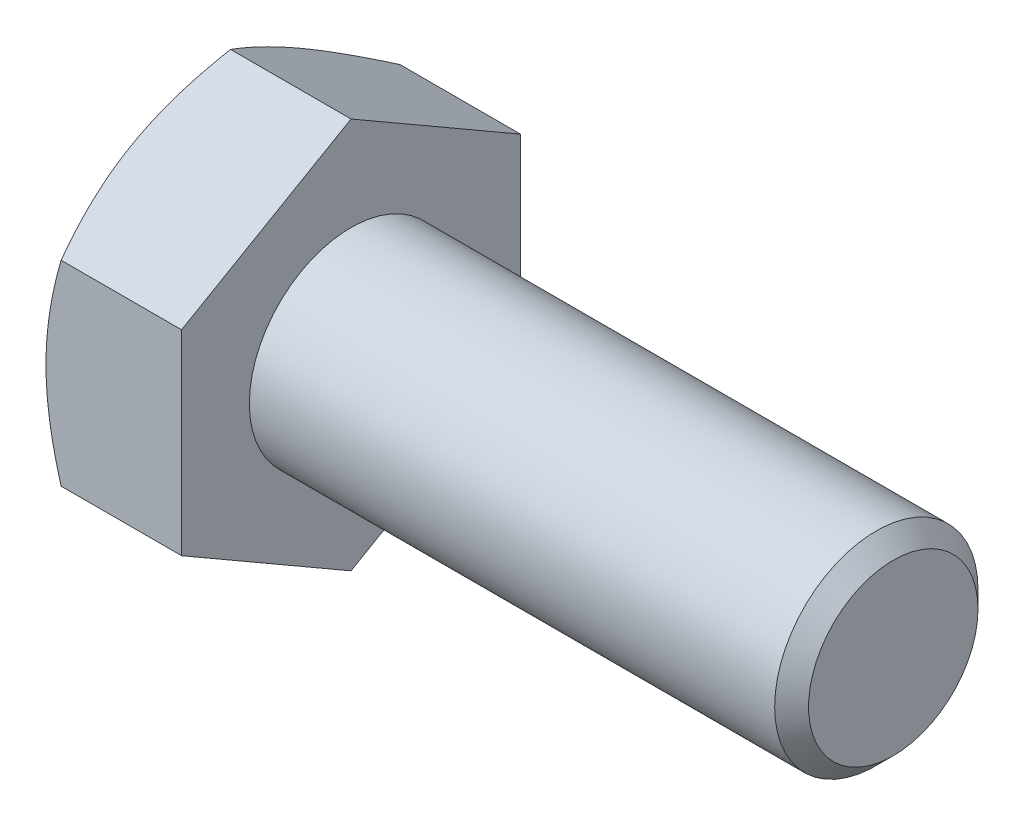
ISO-10303-21;
HEADER;
FILE_DESCRIPTION(('STEP AP214'),'2;1');
FILE_NAME('part.step','',(''),(''),'','','');
FILE_SCHEMA(('AUTOMOTIVE_DESIGN { 1 0 10303 214 1 1 1 1 }'));
ENDSEC;
DATA;
#1=APPLICATION_CONTEXT('core data for automotive mechanical design processes');
#2=APPLICATION_PROTOCOL_DEFINITION('international standard','automotive_design',2000,#1);
#3=PRODUCT_CONTEXT('',#1,'mechanical');
#4=PRODUCT('Part','Part','',(#3));
#5=PRODUCT_RELATED_PRODUCT_CATEGORY('part','',(#4));
#6=PRODUCT_DEFINITION_FORMATION('','',#4);
#7=PRODUCT_DEFINITION_CONTEXT('part definition',#1,'design');
#8=PRODUCT_DEFINITION('design','',#6,#7);
#9=PRODUCT_DEFINITION_SHAPE('','',#8);
#10=(LENGTH_UNIT() NAMED_UNIT(*) SI_UNIT(.MILLI.,.METRE.));
#11=(NAMED_UNIT(*) PLANE_ANGLE_UNIT() SI_UNIT($,.RADIAN.));
#12=(NAMED_UNIT(*) SI_UNIT($,.STERADIAN.) SOLID_ANGLE_UNIT());
#13=UNCERTAINTY_MEASURE_WITH_UNIT(LENGTH_MEASURE(1.E-05),#10,'distance_accuracy_value','');
#14=(GEOMETRIC_REPRESENTATION_CONTEXT(3) GLOBAL_UNCERTAINTY_ASSIGNED_CONTEXT((#13)) GLOBAL_UNIT_ASSIGNED_CONTEXT((#10,
#11,#12)) REPRESENTATION_CONTEXT('',''));
#15=CARTESIAN_POINT('',(0.,0.,0.));
#16=DIRECTION('',(0.,0.,1.));
#17=DIRECTION('',(1.,0.,0.));
#18=AXIS2_PLACEMENT_3D('',#15,#16,#17);
#19=CARTESIAN_POINT('',(16.,0.,0.));
#20=DIRECTION('',(-1.,0.,0.));
#21=DIRECTION('',(0.,0.,1.));
#22=AXIS2_PLACEMENT_3D('',#19,#20,#21);
#23=CYLINDRICAL_SURFACE('',#22,3.);
#24=CARTESIAN_POINT('',(15.5,0.,0.));
#25=DIRECTION('',(1.,0.,0.));
#26=DIRECTION('',(0.,0.,-1.));
#27=AXIS2_PLACEMENT_3D('',#24,#25,#26);
#28=CIRCLE('',#27,3.);
#29=CARTESIAN_POINT('',(15.5,0.,-3.));
#30=VERTEX_POINT('',#29);
#31=EDGE_CURVE('E11',#30,#30,#28,.F.);
#32=ORIENTED_EDGE('',*,*,#31,.T.);
#33=EDGE_LOOP('',(#32));
#34=FACE_BOUND('',#33,.T.);
#35=CARTESIAN_POINT('',(0.,0.,0.));
#36=DIRECTION('',(-1.,0.,0.));
#37=DIRECTION('',(0.,0.,1.));
#38=AXIS2_PLACEMENT_3D('',#35,#36,#37);
#39=CIRCLE('',#38,3.);
#40=CARTESIAN_POINT('',(0.,0.,3.));
#41=VERTEX_POINT('',#40);
#42=EDGE_CURVE('E204',#41,#41,#39,.T.);
#43=ORIENTED_EDGE('',*,*,#42,.F.);
#44=EDGE_LOOP('',(#43));
#45=FACE_BOUND('',#44,.T.);
#46=ADVANCED_FACE('F30',(#34,#45),#23,.T.);
#47=CARTESIAN_POINT('',(16.,0.,0.));
#48=DIRECTION('',(1.,0.,0.));
#49=DIRECTION('',(0.,0.,-1.));
#50=AXIS2_PLACEMENT_3D('',#47,#48,#49);
#51=PLANE('',#50);
#52=CARTESIAN_POINT('',(16.,0.,0.));
#53=DIRECTION('',(1.,0.,0.));
#54=DIRECTION('',(0.,0.,-1.));
#55=AXIS2_PLACEMENT_3D('',#52,#53,#54);
#56=CIRCLE('',#55,2.49999999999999);
#57=CARTESIAN_POINT('',(16.,0.,-2.49999999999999));
#58=VERTEX_POINT('',#57);
#59=EDGE_CURVE('E37',#58,#58,#56,.T.);
#60=ORIENTED_EDGE('',*,*,#59,.T.);
#61=EDGE_LOOP('',(#60));
#62=FACE_BOUND('',#61,.T.);
#63=ADVANCED_FACE('F190',(#62),#51,.T.);
#64=CARTESIAN_POINT('',(0.,-2.88675134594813,5.));
#65=DIRECTION('',(-1.,0.,0.));
#66=DIRECTION('',(0.,0.,1.));
#67=AXIS2_PLACEMENT_3D('',#64,#65,#66);
#68=PLANE('',#67);
#69=DIRECTION('',(0.,0.5,0.866025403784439));
#70=VECTOR('',#69,1.);
#71=CARTESIAN_POINT('',(0.,-5.77350269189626,0.));
#72=LINE('',#71,#70);
#73=CARTESIAN_POINT('',(0.,-5.77350269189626,0.));
#74=VERTEX_POINT('',#73);
#75=CARTESIAN_POINT('',(0.,-2.88675134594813,5.));
#76=VERTEX_POINT('',#75);
#77=EDGE_CURVE('E231',#74,#76,#72,.T.);
#78=ORIENTED_EDGE('',*,*,#77,.F.);
#79=DIRECTION('',(0.,0.5,-0.866025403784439));
#80=VECTOR('',#79,1.);
#81=CARTESIAN_POINT('',(0.,-5.77350269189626,0.));
#82=LINE('',#81,#80);
#83=CARTESIAN_POINT('',(0.,-2.88675134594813,-5.));
#84=VERTEX_POINT('',#83);
#85=EDGE_CURVE('E218',#74,#84,#82,.T.);
#86=ORIENTED_EDGE('',*,*,#85,.T.);
#87=DIRECTION('',(0.,1.,0.));
#88=VECTOR('',#87,1.);
#89=CARTESIAN_POINT('',(0.,-2.88675134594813,-5.));
#90=LINE('',#89,#88);
#91=CARTESIAN_POINT('',(0.,2.88675134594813,-5.));
#92=VERTEX_POINT('',#91);
#93=EDGE_CURVE('E221',#84,#92,#90,.T.);
#94=ORIENTED_EDGE('',*,*,#93,.T.);
#95=DIRECTION('',(0.,0.5,0.866025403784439));
#96=VECTOR('',#95,1.);
#97=CARTESIAN_POINT('',(0.,2.88675134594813,-5.));
#98=LINE('',#97,#96);
#99=CARTESIAN_POINT('',(0.,5.77350269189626,0.));
#100=VERTEX_POINT('',#99);
#101=EDGE_CURVE('E224',#92,#100,#98,.T.);
#102=ORIENTED_EDGE('',*,*,#101,.T.);
#103=DIRECTION('',(0.,0.5,-0.866025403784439));
#104=VECTOR('',#103,1.);
#105=CARTESIAN_POINT('',(0.,2.88675134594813,5.));
#106=LINE('',#105,#104);
#107=CARTESIAN_POINT('',(0.,2.88675134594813,5.));
#108=VERTEX_POINT('',#107);
#109=EDGE_CURVE('E227',#108,#100,#106,.T.);
#110=ORIENTED_EDGE('',*,*,#109,.F.);
#111=DIRECTION('',(0.,1.,0.));
#112=VECTOR('',#111,1.);
#113=CARTESIAN_POINT('',(0.,-2.88675134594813,5.));
#114=LINE('',#113,#112);
#115=EDGE_CURVE('E229',#76,#108,#114,.T.);
#116=ORIENTED_EDGE('',*,*,#115,.F.);
#117=EDGE_LOOP('',(#78,#86,#94,#102,#110,#116));
#118=FACE_BOUND('',#117,.T.);
#119=ORIENTED_EDGE('',*,*,#42,.T.);
#120=EDGE_LOOP('',(#119));
#121=FACE_BOUND('',#120,.T.);
#122=ADVANCED_FACE('F161',(#118,#121),#68,.F.);
#123=CARTESIAN_POINT('',(-4.,-5.77350269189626,0.));
#124=DIRECTION('',(0.,0.866025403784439,-0.5));
#125=DIRECTION('',(0.,0.5,0.866025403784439));
#126=AXIS2_PLACEMENT_3D('',#123,#124,#125);
#127=PLANE('',#126);
#128=CARTESIAN_POINT('',(-3.55335134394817,-5.7736181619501,-0.000200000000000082));
#129=CARTESIAN_POINT('',(-3.62661343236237,-5.64675433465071,0.219534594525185));
#130=CARTESIAN_POINT('',(-3.69324867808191,-5.5188054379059,0.44114858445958));
#131=CARTESIAN_POINT('',(-3.80956100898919,-5.26069210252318,0.888213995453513));
#132=CARTESIAN_POINT('',(-3.85919695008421,-5.13052307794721,1.11367335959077));
#133=CARTESIAN_POINT('',(-3.9364489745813,-4.87177839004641,1.56183230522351));
#134=CARTESIAN_POINT('',(-3.96457962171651,-4.74324302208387,1.78446209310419));
#135=CARTESIAN_POINT('',(-3.98980507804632,-4.54998783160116,2.11918990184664));
#136=CARTESIAN_POINT('',(-3.99538654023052,-4.48552534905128,2.23084219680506));
#137=CARTESIAN_POINT('',(-4.00079778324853,-4.35654081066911,2.4542499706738));
#138=CARTESIAN_POINT('',(-4.0006277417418,-4.2920187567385,2.56600544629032));
#139=CARTESIAN_POINT('',(-3.99224636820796,-4.11524635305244,2.87218423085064));
#140=CARTESIAN_POINT('',(-3.97817022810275,-4.00305457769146,3.06650608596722));
#141=CARTESIAN_POINT('',(-3.93353474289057,-3.77941563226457,3.45386010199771));
#142=CARTESIAN_POINT('',(-3.90296013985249,-3.66796924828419,3.64689090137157));
#143=CARTESIAN_POINT('',(-3.82653150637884,-3.44387972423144,4.03502534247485));
#144=CARTESIAN_POINT('',(-3.78035362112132,-3.3312648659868,4.23007999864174));
#145=CARTESIAN_POINT('',(-3.67554820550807,-3.10771464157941,4.61728034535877));
#146=CARTESIAN_POINT('',(-3.61694529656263,-2.99677641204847,4.80943099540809));
#147=CARTESIAN_POINT('',(-3.55335134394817,-2.88663587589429,5.0002));
#148=B_SPLINE_CURVE_WITH_KNOTS('',3,(#128,#129,#130,#131,#132,#133,#134,#135,#136,#137,#138,
#139,#140,#141,#142,#143,#144,#145,#146,#147),.UNSPECIFIED.,.F.,.F.,(4,2,2,2,2,2,2,2,2,4),(0.,
0.79255584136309,1.58701660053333,2.36181537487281,2.74884076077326,3.13585419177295,
3.80962362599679,4.48401723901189,5.17336882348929,5.86136694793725),.UNSPECIFIED.);
#149=CARTESIAN_POINT('',(-3.5534180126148,-5.77350269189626,0.));
#150=VERTEX_POINT('',#149);
#151=CARTESIAN_POINT('',(-4.,-4.3301270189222,2.5));
#152=VERTEX_POINT('',#151);
#153=EDGE_CURVE('E178',#150,#152,#148,.T.);
#154=ORIENTED_EDGE('',*,*,#153,.F.);
#155=DIRECTION('',(1.,0.,0.));
#156=VECTOR('',#155,1.);
#157=CARTESIAN_POINT('',(-4.,-5.77350269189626,0.));
#158=LINE('',#157,#156);
#159=EDGE_CURVE('E216',#150,#74,#158,.T.);
#160=ORIENTED_EDGE('',*,*,#159,.T.);
#161=ORIENTED_EDGE('',*,*,#77,.T.);
#162=DIRECTION('',(1.,0.,0.));
#163=VECTOR('',#162,1.);
#164=CARTESIAN_POINT('',(-4.,-2.88675134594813,5.));
#165=LINE('',#164,#163);
#166=CARTESIAN_POINT('',(-3.5534180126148,-2.88675134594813,5.));
#167=VERTEX_POINT('',#166);
#168=EDGE_CURVE('E207',#167,#76,#165,.T.);
#169=ORIENTED_EDGE('',*,*,#168,.F.);
#170=EDGE_CURVE('E132',#152,#167,#148,.T.);
#171=ORIENTED_EDGE('',*,*,#170,.F.);
#172=EDGE_LOOP('',(#154,#160,#161,#169,#171));
#173=FACE_BOUND('',#172,.T.);
#174=ADVANCED_FACE('F184',(#173),#127,.F.);
#175=CARTESIAN_POINT('',(-4.,-2.88675134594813,5.));
#176=DIRECTION('',(0.,0.,-1.));
#177=DIRECTION('',(-1.,0.,0.));
#178=AXIS2_PLACEMENT_3D('',#175,#176,#177);
#179=PLANE('',#178);
#180=CARTESIAN_POINT('',(-1.50175754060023,-7.8736570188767,5.));
#181=CARTESIAN_POINT('',(-1.6086809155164,-7.65421637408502,5.));
#182=CARTESIAN_POINT('',(-1.71461296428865,-7.43428458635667,5.));
#183=CARTESIAN_POINT('',(-1.92393906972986,-6.99317792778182,5.));
#184=CARTESIAN_POINT('',(-2.02733274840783,-6.77200287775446,5.));
#185=CARTESIAN_POINT('',(-2.23152152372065,-6.32706593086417,5.));
#186=CARTESIAN_POINT('',(-2.33230041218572,-6.10329657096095,5.));
#187=CARTESIAN_POINT('',(-2.52988978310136,-5.65401907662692,5.));
#188=CARTESIAN_POINT('',(-2.62670044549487,-5.42851102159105,5.));
#189=CARTESIAN_POINT('',(-2.81850105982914,-4.96773019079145,5.));
#190=CARTESIAN_POINT('',(-2.91331851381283,-4.73238523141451,5.));
#191=CARTESIAN_POINT('',(-3.09606229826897,-4.25898650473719,5.));
#192=CARTESIAN_POINT('',(-3.18398787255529,-4.02093244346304,5.));
#193=CARTESIAN_POINT('',(-3.35072723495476,-3.54214478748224,5.));
#194=CARTESIAN_POINT('',(-3.42955846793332,-3.30141732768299,5.));
#195=CARTESIAN_POINT('',(-3.57565910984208,-2.81651125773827,5.));
#196=CARTESIAN_POINT('',(-3.64293203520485,-2.5723337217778,5.));
#197=CARTESIAN_POINT('',(-3.7624103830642,-2.08173956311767,5.));
#198=CARTESIAN_POINT('',(-3.81470009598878,-1.83534384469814,5.));
#199=CARTESIAN_POINT('',(-3.90133365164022,-1.33936717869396,5.));
#200=CARTESIAN_POINT('',(-3.93567944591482,-1.08978658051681,5.));
#201=CARTESIAN_POINT('',(-3.98324171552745,-0.59199465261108,5.));
#202=CARTESIAN_POINT('',(-3.99673913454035,-0.343810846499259,5.));
#203=CARTESIAN_POINT('',(-4.00220795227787,0.152820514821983,5.));
#204=CARTESIAN_POINT('',(-3.99417903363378,0.401268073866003,5.));
#205=CARTESIAN_POINT('',(-3.96311999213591,0.819539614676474,5.));
#206=CARTESIAN_POINT('',(-3.94552930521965,0.989794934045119,5.));
#207=CARTESIAN_POINT('',(-3.90127081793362,1.32912938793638,5.));
#208=CARTESIAN_POINT('',(-3.87460188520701,1.4982083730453,5.));
#209=CARTESIAN_POINT('',(-3.78237229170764,2.00341173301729,5.));
#210=CARTESIAN_POINT('',(-3.7046029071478,2.337335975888,5.));
#211=CARTESIAN_POINT('',(-3.56883106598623,2.83691487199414,5.));
#212=CARTESIAN_POINT('',(-3.51971360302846,3.00513229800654,5.));
#213=CARTESIAN_POINT('',(-3.41615110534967,3.33993504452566,5.));
#214=CARTESIAN_POINT('',(-3.36170602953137,3.5065203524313,5.));
#215=CARTESIAN_POINT('',(-3.24838071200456,3.83810926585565,5.));
#216=CARTESIAN_POINT('',(-3.18950171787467,4.00311330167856,5.));
#217=CARTESIAN_POINT('',(-3.0680238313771,4.33173746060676,5.));
#218=CARTESIAN_POINT('',(-3.00542502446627,4.49535761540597,5.));
#219=CARTESIAN_POINT('',(-2.83201950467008,4.93598294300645,5.));
#220=CARTESIAN_POINT('',(-2.71826266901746,5.21182602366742,5.));
#221=CARTESIAN_POINT('',(-2.48405585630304,5.76066658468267,5.));
#222=CARTESIAN_POINT('',(-2.36360513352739,6.03366374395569,5.));
#223=CARTESIAN_POINT('',(-2.11759609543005,6.57746623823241,5.));
#224=CARTESIAN_POINT('',(-1.99203582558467,6.84827068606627,5.));
#225=CARTESIAN_POINT('',(-1.73703058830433,7.38802449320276,5.));
#226=CARTESIAN_POINT('',(-1.60758577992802,7.65697392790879,5.));
#227=CARTESIAN_POINT('',(-1.34544789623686,8.19381940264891,5.));
#228=CARTESIAN_POINT('',(-1.21274991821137,8.46171304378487,5.));
#229=CARTESIAN_POINT('',(-0.944933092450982,8.99628800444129,5.));
#230=CARTESIAN_POINT('',(-0.809814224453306,9.26296931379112,5.));
#231=CARTESIAN_POINT('',(-0.401627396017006,10.0614145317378,5.));
#232=CARTESIAN_POINT('',(-0.125669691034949,10.5917004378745,5.));
#233=CARTESIAN_POINT('',(0.401869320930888,11.5934978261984,5.));
#234=CARTESIAN_POINT('',(0.652934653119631,12.0652823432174,5.));
#235=CARTESIAN_POINT('',(1.15809174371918,13.0072652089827,5.));
#236=CARTESIAN_POINT('',(1.41218368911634,13.4774634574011,5.));
#237=CARTESIAN_POINT('',(1.92174727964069,14.4150598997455,5.));
#238=CARTESIAN_POINT('',(2.17721139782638,14.8824621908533,5.));
#239=CARTESIAN_POINT('',(2.68985606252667,15.8162766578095,5.));
#240=CARTESIAN_POINT('',(2.94703647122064,16.2826889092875,5.));
#241=CARTESIAN_POINT('',(3.20484156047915,16.7487534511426,5.));
#242=B_SPLINE_CURVE_WITH_KNOTS('',3,(#180,#181,#182,#183,#184,#185,#186,#187,#188,#189,#190,
#191,#192,#193,#194,#195,#196,#197,#198,#199,#200,#201,#202,#203,#204,#205,#206,#207,#208,#209,
#210,#211,#212,#213,#214,#215,#216,#217,#218,#219,#220,#221,#222,#223,#224,#225,#226,#227,#228,
#229,#230,#231,#232,#233,#234,#235,#236,#237,#238,#239,#240,#241),.UNSPECIFIED.,.F.,.F.,(4,2,2,
2,2,2,2,2,2,2,2,2,2,2,2,2,2,2,2,2,2,2,2,2,2,2,2,2,2,2,4),(0.,0.732320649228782,1.46474969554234,
2.20096737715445,2.93715163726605,3.69825037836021,4.45943251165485,5.21912936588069,
5.97859468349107,6.73369963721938,7.48872245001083,8.23347928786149,8.97824710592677,
9.49148539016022,10.0047877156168,11.0318914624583,11.5575684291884,12.0832494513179,
12.6087831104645,13.1343047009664,14.0293094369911,14.9244140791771,15.819864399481,
16.7152781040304,17.612136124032,18.5090016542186,20.3023290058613,21.9056050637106,
23.5089806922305,25.106957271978,26.7048070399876),.UNSPECIFIED.);
#243=CARTESIAN_POINT('',(-4.,0.,5.));
#244=VERTEX_POINT('',#243);
#245=EDGE_CURVE('E233',#167,#244,#242,.T.);
#246=ORIENTED_EDGE('',*,*,#245,.F.);
#247=ORIENTED_EDGE('',*,*,#168,.T.);
#248=ORIENTED_EDGE('',*,*,#115,.T.);
#249=DIRECTION('',(1.,0.,0.));
#250=VECTOR('',#249,1.);
#251=CARTESIAN_POINT('',(-4.,2.88675134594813,5.));
#252=LINE('',#251,#250);
#253=CARTESIAN_POINT('',(-3.5534180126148,2.88675134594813,5.));
#254=VERTEX_POINT('',#253);
#255=EDGE_CURVE('E209',#254,#108,#252,.T.);
#256=ORIENTED_EDGE('',*,*,#255,.F.);
#257=EDGE_CURVE('E103',#244,#254,#242,.T.);
#258=ORIENTED_EDGE('',*,*,#257,.F.);
#259=EDGE_LOOP('',(#246,#247,#248,#256,#258));
#260=FACE_BOUND('',#259,.T.);
#261=ADVANCED_FACE('F187',(#260),#179,.F.);
#262=CARTESIAN_POINT('',(-4.,2.88675134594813,5.));
#263=DIRECTION('',(0.,-0.866025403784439,-0.5));
#264=DIRECTION('',(0.,0.5,-0.866025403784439));
#265=AXIS2_PLACEMENT_3D('',#262,#263,#264);
#266=PLANE('',#265);
#267=CARTESIAN_POINT('',(-3.55335134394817,2.88663587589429,5.0002));
#268=CARTESIAN_POINT('',(-3.62661343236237,3.01349970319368,4.78046540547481));
#269=CARTESIAN_POINT('',(-3.69324867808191,3.14144859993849,4.55885141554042));
#270=CARTESIAN_POINT('',(-3.80956100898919,3.39956193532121,4.11178600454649));
#271=CARTESIAN_POINT('',(-3.85919695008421,3.52973095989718,3.88632664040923));
#272=CARTESIAN_POINT('',(-3.9364489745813,3.78847564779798,3.43816769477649));
#273=CARTESIAN_POINT('',(-3.96457962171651,3.91701101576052,3.21553790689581));
#274=CARTESIAN_POINT('',(-3.98980507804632,4.11026620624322,2.88081009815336));
#275=CARTESIAN_POINT('',(-3.99538654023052,4.17472868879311,2.76915780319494));
#276=CARTESIAN_POINT('',(-4.00079778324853,4.30371322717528,2.5457500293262));
#277=CARTESIAN_POINT('',(-4.0006277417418,4.36823528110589,2.43399455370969));
#278=CARTESIAN_POINT('',(-3.99224636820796,4.54500768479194,2.12781576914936));
#279=CARTESIAN_POINT('',(-3.97817022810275,4.65719946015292,1.93349391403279));
#280=CARTESIAN_POINT('',(-3.93353474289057,4.88083840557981,1.54613989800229));
#281=CARTESIAN_POINT('',(-3.90296013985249,4.9922847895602,1.35310909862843));
#282=CARTESIAN_POINT('',(-3.82653150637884,5.21637431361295,0.964974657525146));
#283=CARTESIAN_POINT('',(-3.78035362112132,5.32898917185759,0.769920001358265));
#284=CARTESIAN_POINT('',(-3.67554820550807,5.55253939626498,0.382719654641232));
#285=CARTESIAN_POINT('',(-3.61694529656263,5.66347762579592,0.190569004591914));
#286=CARTESIAN_POINT('',(-3.55335134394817,5.7736181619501,-0.000199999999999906));
#287=B_SPLINE_CURVE_WITH_KNOTS('',3,(#267,#268,#269,#270,#271,#272,#273,#274,#275,#276,#277,
#278,#279,#280,#281,#282,#283,#284,#285,#286),.UNSPECIFIED.,.F.,.F.,(4,2,2,2,2,2,2,2,2,4),(0.,
0.792555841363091,1.58701660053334,2.36181537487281,2.74884076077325,3.13585419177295,
3.80962362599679,4.48401723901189,5.17336882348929,5.86136694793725),.UNSPECIFIED.);
#288=CARTESIAN_POINT('',(-4.,4.33012701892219,2.5));
#289=VERTEX_POINT('',#288);
#290=EDGE_CURVE('E99',#254,#289,#287,.T.);
#291=ORIENTED_EDGE('',*,*,#290,.F.);
#292=ORIENTED_EDGE('',*,*,#255,.T.);
#293=ORIENTED_EDGE('',*,*,#109,.T.);
#294=DIRECTION('',(1.,0.,0.));
#295=VECTOR('',#294,1.);
#296=CARTESIAN_POINT('',(-4.,5.77350269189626,0.));
#297=LINE('',#296,#295);
#298=CARTESIAN_POINT('',(-3.5534180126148,5.77350269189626,0.));
#299=VERTEX_POINT('',#298);
#300=EDGE_CURVE('E131',#299,#100,#297,.T.);
#301=ORIENTED_EDGE('',*,*,#300,.F.);
#302=EDGE_CURVE('E107',#289,#299,#287,.T.);
#303=ORIENTED_EDGE('',*,*,#302,.F.);
#304=EDGE_LOOP('',(#291,#292,#293,#301,#303));
#305=FACE_BOUND('',#304,.T.);
#306=ADVANCED_FACE('F129',(#305),#266,.F.);
#307=CARTESIAN_POINT('',(-4.,2.88675134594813,-5.));
#308=DIRECTION('',(0.,0.866025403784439,-0.5));
#309=DIRECTION('',(0.,0.5,0.866025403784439));
#310=AXIS2_PLACEMENT_3D('',#307,#308,#309);
#311=PLANE('',#310);
#312=DIRECTION('',(1.,0.,0.));
#313=VECTOR('',#312,1.);
#314=CARTESIAN_POINT('',(-4.,2.88675134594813,-5.));
#315=LINE('',#314,#313);
#316=CARTESIAN_POINT('',(-3.5534180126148,2.88675134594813,-5.));
#317=VERTEX_POINT('',#316);
#318=EDGE_CURVE('E212',#317,#92,#315,.T.);
#319=ORIENTED_EDGE('',*,*,#318,.F.);
#320=CARTESIAN_POINT('',(-3.55335134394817,2.88663587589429,-5.0002));
#321=CARTESIAN_POINT('',(-3.62661343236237,3.01349970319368,-4.78046540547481));
#322=CARTESIAN_POINT('',(-3.69324867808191,3.14144859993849,-4.55885141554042));
#323=CARTESIAN_POINT('',(-3.80956100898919,3.39956193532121,-4.11178600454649));
#324=CARTESIAN_POINT('',(-3.85919695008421,3.52973095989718,-3.88632664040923));
#325=CARTESIAN_POINT('',(-3.9364489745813,3.78847564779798,-3.43816769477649));
#326=CARTESIAN_POINT('',(-3.96457962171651,3.91701101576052,-3.21553790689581));
#327=CARTESIAN_POINT('',(-3.98980507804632,4.11026620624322,-2.88081009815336));
#328=CARTESIAN_POINT('',(-3.99538654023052,4.17472868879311,-2.76915780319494));
#329=CARTESIAN_POINT('',(-4.00079778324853,4.30371322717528,-2.5457500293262));
#330=CARTESIAN_POINT('',(-4.0006277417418,4.36823528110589,-2.43399455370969));
#331=CARTESIAN_POINT('',(-3.99224636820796,4.54500768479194,-2.12781576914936));
#332=CARTESIAN_POINT('',(-3.97817022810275,4.65719946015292,-1.93349391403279));
#333=CARTESIAN_POINT('',(-3.93353474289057,4.88083840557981,-1.54613989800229));
#334=CARTESIAN_POINT('',(-3.90296013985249,4.9922847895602,-1.35310909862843));
#335=CARTESIAN_POINT('',(-3.82653150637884,5.21637431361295,-0.964974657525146));
#336=CARTESIAN_POINT('',(-3.78035362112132,5.32898917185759,-0.769920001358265));
#337=CARTESIAN_POINT('',(-3.67554820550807,5.55253939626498,-0.382719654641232));
#338=CARTESIAN_POINT('',(-3.61694529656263,5.66347762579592,-0.190569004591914));
#339=CARTESIAN_POINT('',(-3.55335134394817,5.7736181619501,0.000199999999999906));
#340=B_SPLINE_CURVE_WITH_KNOTS('',3,(#320,#321,#322,#323,#324,#325,#326,#327,#328,#329,#330,
#331,#332,#333,#334,#335,#336,#337,#338,#339),.UNSPECIFIED.,.F.,.F.,(4,2,2,2,2,2,2,2,2,4),(0.,
0.792555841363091,1.58701660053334,2.36181537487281,2.74884076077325,3.13585419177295,
3.80962362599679,4.48401723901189,5.17336882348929,5.86136694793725),.UNSPECIFIED.);
#341=CARTESIAN_POINT('',(-4.,4.33012701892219,-2.5));
#342=VERTEX_POINT('',#341);
#343=EDGE_CURVE('E134',#317,#342,#340,.T.);
#344=ORIENTED_EDGE('',*,*,#343,.T.);
#345=EDGE_CURVE('E114',#342,#299,#340,.T.);
#346=ORIENTED_EDGE('',*,*,#345,.T.);
#347=ORIENTED_EDGE('',*,*,#300,.T.);
#348=ORIENTED_EDGE('',*,*,#101,.F.);
#349=EDGE_LOOP('',(#319,#344,#346,#347,#348));
#350=FACE_BOUND('',#349,.T.);
#351=ADVANCED_FACE('F259',(#350),#311,.T.);
#352=CARTESIAN_POINT('',(-4.,-2.88675134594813,-5.));
#353=DIRECTION('',(0.,0.,-1.));
#354=DIRECTION('',(-1.,0.,0.));
#355=AXIS2_PLACEMENT_3D('',#352,#353,#354);
#356=PLANE('',#355);
#357=DIRECTION('',(1.,0.,0.));
#358=VECTOR('',#357,1.);
#359=CARTESIAN_POINT('',(-4.,-2.88675134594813,-5.));
#360=LINE('',#359,#358);
#361=CARTESIAN_POINT('',(-3.5534180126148,-2.88675134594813,-5.));
#362=VERTEX_POINT('',#361);
#363=EDGE_CURVE('E214',#362,#84,#360,.T.);
#364=ORIENTED_EDGE('',*,*,#363,.F.);
#365=CARTESIAN_POINT('',(-1.50175754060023,-7.8736570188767,-5.));
#366=CARTESIAN_POINT('',(-1.6086809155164,-7.65421637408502,-5.));
#367=CARTESIAN_POINT('',(-1.71461296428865,-7.43428458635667,-5.));
#368=CARTESIAN_POINT('',(-1.92393906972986,-6.99317792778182,-5.));
#369=CARTESIAN_POINT('',(-2.02733274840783,-6.77200287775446,-5.));
#370=CARTESIAN_POINT('',(-2.23152152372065,-6.32706593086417,-5.));
#371=CARTESIAN_POINT('',(-2.33230041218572,-6.10329657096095,-5.));
#372=CARTESIAN_POINT('',(-2.52988978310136,-5.65401907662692,-5.));
#373=CARTESIAN_POINT('',(-2.62670044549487,-5.42851102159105,-5.));
#374=CARTESIAN_POINT('',(-2.81850105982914,-4.96773019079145,-5.));
#375=CARTESIAN_POINT('',(-2.91331851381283,-4.73238523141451,-5.));
#376=CARTESIAN_POINT('',(-3.09606229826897,-4.25898650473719,-5.));
#377=CARTESIAN_POINT('',(-3.18398787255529,-4.02093244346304,-5.));
#378=CARTESIAN_POINT('',(-3.35072723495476,-3.54214478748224,-5.));
#379=CARTESIAN_POINT('',(-3.42955846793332,-3.30141732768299,-5.));
#380=CARTESIAN_POINT('',(-3.57565910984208,-2.81651125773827,-5.));
#381=CARTESIAN_POINT('',(-3.64293203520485,-2.5723337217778,-5.));
#382=CARTESIAN_POINT('',(-3.7624103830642,-2.08173956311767,-5.));
#383=CARTESIAN_POINT('',(-3.81470009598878,-1.83534384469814,-5.));
#384=CARTESIAN_POINT('',(-3.90133365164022,-1.33936717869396,-5.));
#385=CARTESIAN_POINT('',(-3.93567944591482,-1.08978658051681,-5.));
#386=CARTESIAN_POINT('',(-3.98324171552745,-0.59199465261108,-5.));
#387=CARTESIAN_POINT('',(-3.99673913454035,-0.343810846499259,-5.));
#388=CARTESIAN_POINT('',(-4.00220795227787,0.152820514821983,-5.));
#389=CARTESIAN_POINT('',(-3.99417903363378,0.401268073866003,-5.));
#390=CARTESIAN_POINT('',(-3.96311999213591,0.819539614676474,-5.));
#391=CARTESIAN_POINT('',(-3.94552930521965,0.989794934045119,-5.));
#392=CARTESIAN_POINT('',(-3.90127081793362,1.32912938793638,-5.));
#393=CARTESIAN_POINT('',(-3.87460188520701,1.4982083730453,-5.));
#394=CARTESIAN_POINT('',(-3.78237229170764,2.00341173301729,-5.));
#395=CARTESIAN_POINT('',(-3.7046029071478,2.337335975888,-5.));
#396=CARTESIAN_POINT('',(-3.56883106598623,2.83691487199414,-5.));
#397=CARTESIAN_POINT('',(-3.51971360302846,3.00513229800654,-5.));
#398=CARTESIAN_POINT('',(-3.41615110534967,3.33993504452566,-5.));
#399=CARTESIAN_POINT('',(-3.36170602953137,3.5065203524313,-5.));
#400=CARTESIAN_POINT('',(-3.24838071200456,3.83810926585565,-5.));
#401=CARTESIAN_POINT('',(-3.18950171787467,4.00311330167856,-5.));
#402=CARTESIAN_POINT('',(-3.0680238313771,4.33173746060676,-5.));
#403=CARTESIAN_POINT('',(-3.00542502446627,4.49535761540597,-5.));
#404=CARTESIAN_POINT('',(-2.83201950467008,4.93598294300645,-5.));
#405=CARTESIAN_POINT('',(-2.71826266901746,5.21182602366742,-5.));
#406=CARTESIAN_POINT('',(-2.48405585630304,5.76066658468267,-5.));
#407=CARTESIAN_POINT('',(-2.36360513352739,6.03366374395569,-5.));
#408=CARTESIAN_POINT('',(-2.11759609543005,6.57746623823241,-5.));
#409=CARTESIAN_POINT('',(-1.99203582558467,6.84827068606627,-5.));
#410=CARTESIAN_POINT('',(-1.73703058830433,7.38802449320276,-5.));
#411=CARTESIAN_POINT('',(-1.60758577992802,7.65697392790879,-5.));
#412=CARTESIAN_POINT('',(-1.34544789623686,8.19381940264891,-5.));
#413=CARTESIAN_POINT('',(-1.21274991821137,8.46171304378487,-5.));
#414=CARTESIAN_POINT('',(-0.944933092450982,8.99628800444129,-5.));
#415=CARTESIAN_POINT('',(-0.809814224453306,9.26296931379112,-5.));
#416=CARTESIAN_POINT('',(-0.401627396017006,10.0614145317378,-5.));
#417=CARTESIAN_POINT('',(-0.125669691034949,10.5917004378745,-5.));
#418=CARTESIAN_POINT('',(0.401869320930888,11.5934978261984,-5.));
#419=CARTESIAN_POINT('',(0.652934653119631,12.0652823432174,-5.));
#420=CARTESIAN_POINT('',(1.15809174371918,13.0072652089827,-5.));
#421=CARTESIAN_POINT('',(1.41218368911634,13.4774634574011,-5.));
#422=CARTESIAN_POINT('',(1.92174727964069,14.4150598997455,-5.));
#423=CARTESIAN_POINT('',(2.17721139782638,14.8824621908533,-5.));
#424=CARTESIAN_POINT('',(2.68985606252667,15.8162766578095,-5.));
#425=CARTESIAN_POINT('',(2.94703647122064,16.2826889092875,-5.));
#426=CARTESIAN_POINT('',(3.20484156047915,16.7487534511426,-5.));
#427=B_SPLINE_CURVE_WITH_KNOTS('',3,(#365,#366,#367,#368,#369,#370,#371,#372,#373,#374,#375,
#376,#377,#378,#379,#380,#381,#382,#383,#384,#385,#386,#387,#388,#389,#390,#391,#392,#393,#394,
#395,#396,#397,#398,#399,#400,#401,#402,#403,#404,#405,#406,#407,#408,#409,#410,#411,#412,#413,
#414,#415,#416,#417,#418,#419,#420,#421,#422,#423,#424,#425,#426),.UNSPECIFIED.,.F.,.F.,(4,2,2,
2,2,2,2,2,2,2,2,2,2,2,2,2,2,2,2,2,2,2,2,2,2,2,2,2,2,2,4),(0.,0.732320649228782,1.46474969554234,
2.20096737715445,2.93715163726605,3.69825037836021,4.45943251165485,5.21912936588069,
5.97859468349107,6.73369963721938,7.48872245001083,8.23347928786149,8.97824710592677,
9.49148539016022,10.0047877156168,11.0318914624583,11.5575684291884,12.0832494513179,
12.6087831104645,13.1343047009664,14.0293094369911,14.9244140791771,15.819864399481,
16.7152781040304,17.612136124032,18.5090016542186,20.3023290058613,21.9056050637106,
23.5089806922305,25.106957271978,26.7048070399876),.UNSPECIFIED.);
#428=CARTESIAN_POINT('',(-4.,0.,-5.));
#429=VERTEX_POINT('',#428);
#430=EDGE_CURVE('E52',#362,#429,#427,.T.);
#431=ORIENTED_EDGE('',*,*,#430,.T.);
#432=EDGE_CURVE('E183',#429,#317,#427,.T.);
#433=ORIENTED_EDGE('',*,*,#432,.T.);
#434=ORIENTED_EDGE('',*,*,#318,.T.);
#435=ORIENTED_EDGE('',*,*,#93,.F.);
#436=EDGE_LOOP('',(#364,#431,#433,#434,#435));
#437=FACE_BOUND('',#436,.T.);
#438=ADVANCED_FACE('F255',(#437),#356,.T.);
#439=CARTESIAN_POINT('',(-4.,-5.77350269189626,0.));
#440=DIRECTION('',(0.,-0.866025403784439,-0.5));
#441=DIRECTION('',(0.,0.5,-0.866025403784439));
#442=AXIS2_PLACEMENT_3D('',#439,#440,#441);
#443=PLANE('',#442);
#444=ORIENTED_EDGE('',*,*,#159,.F.);
#445=CARTESIAN_POINT('',(-3.55335134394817,-5.7736181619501,0.000200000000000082));
#446=CARTESIAN_POINT('',(-3.62661343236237,-5.64675433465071,-0.219534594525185));
#447=CARTESIAN_POINT('',(-3.69324867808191,-5.5188054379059,-0.44114858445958));
#448=CARTESIAN_POINT('',(-3.80956100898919,-5.26069210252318,-0.888213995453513));
#449=CARTESIAN_POINT('',(-3.85919695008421,-5.13052307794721,-1.11367335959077));
#450=CARTESIAN_POINT('',(-3.9364489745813,-4.87177839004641,-1.56183230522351));
#451=CARTESIAN_POINT('',(-3.96457962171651,-4.74324302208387,-1.78446209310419));
#452=CARTESIAN_POINT('',(-3.98980507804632,-4.54998783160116,-2.11918990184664));
#453=CARTESIAN_POINT('',(-3.99538654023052,-4.48552534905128,-2.23084219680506));
#454=CARTESIAN_POINT('',(-4.00079778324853,-4.35654081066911,-2.4542499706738));
#455=CARTESIAN_POINT('',(-4.0006277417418,-4.2920187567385,-2.56600544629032));
#456=CARTESIAN_POINT('',(-3.99224636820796,-4.11524635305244,-2.87218423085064));
#457=CARTESIAN_POINT('',(-3.97817022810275,-4.00305457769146,-3.06650608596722));
#458=CARTESIAN_POINT('',(-3.93353474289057,-3.77941563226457,-3.45386010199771));
#459=CARTESIAN_POINT('',(-3.90296013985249,-3.66796924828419,-3.64689090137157));
#460=CARTESIAN_POINT('',(-3.82653150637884,-3.44387972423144,-4.03502534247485));
#461=CARTESIAN_POINT('',(-3.78035362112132,-3.3312648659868,-4.23007999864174));
#462=CARTESIAN_POINT('',(-3.67554820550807,-3.10771464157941,-4.61728034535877));
#463=CARTESIAN_POINT('',(-3.61694529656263,-2.99677641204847,-4.80943099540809));
#464=CARTESIAN_POINT('',(-3.55335134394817,-2.88663587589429,-5.0002));
#465=B_SPLINE_CURVE_WITH_KNOTS('',3,(#445,#446,#447,#448,#449,#450,#451,#452,#453,#454,#455,
#456,#457,#458,#459,#460,#461,#462,#463,#464),.UNSPECIFIED.,.F.,.F.,(4,2,2,2,2,2,2,2,2,4),(0.,
0.79255584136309,1.58701660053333,2.36181537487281,2.74884076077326,3.13585419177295,
3.80962362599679,4.48401723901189,5.17336882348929,5.86136694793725),.UNSPECIFIED.);
#466=CARTESIAN_POINT('',(-4.,-4.3301270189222,-2.5));
#467=VERTEX_POINT('',#466);
#468=EDGE_CURVE('E247',#150,#467,#465,.T.);
#469=ORIENTED_EDGE('',*,*,#468,.T.);
#470=EDGE_CURVE('E126',#467,#362,#465,.T.);
#471=ORIENTED_EDGE('',*,*,#470,.T.);
#472=ORIENTED_EDGE('',*,*,#363,.T.);
#473=ORIENTED_EDGE('',*,*,#85,.F.);
#474=EDGE_LOOP('',(#444,#469,#471,#472,#473));
#475=FACE_BOUND('',#474,.T.);
#476=ADVANCED_FACE('F251',(#475),#443,.T.);
#477=CARTESIAN_POINT('',(-4.,0.,0.));
#478=DIRECTION('',(1.,0.,0.));
#479=DIRECTION('',(0.,0.,1.));
#480=AXIS2_PLACEMENT_3D('',#477,#478,#479);
#481=CONICAL_SURFACE('',#480,5.,1.0471975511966);
#482=ORIENTED_EDGE('',*,*,#170,.T.);
#483=ORIENTED_EDGE('',*,*,#245,.T.);
#484=CARTESIAN_POINT('',(-4.,0.,0.));
#485=DIRECTION('',(-1.,0.,0.));
#486=DIRECTION('',(0.,0.,1.));
#487=AXIS2_PLACEMENT_3D('',#484,#485,#486);
#488=CIRCLE('',#487,5.);
#489=EDGE_CURVE('E121',#152,#244,#488,.T.);
#490=ORIENTED_EDGE('',*,*,#489,.F.);
#491=EDGE_LOOP('',(#482,#483,#490));
#492=FACE_BOUND('',#491,.T.);
#493=ADVANCED_FACE('F159',(#492),#481,.T.);
#494=ORIENTED_EDGE('',*,*,#468,.F.);
#495=ORIENTED_EDGE('',*,*,#153,.T.);
#496=EDGE_CURVE('E203',#467,#152,#488,.T.);
#497=ORIENTED_EDGE('',*,*,#496,.F.);
#498=EDGE_LOOP('',(#494,#495,#497));
#499=FACE_BOUND('',#498,.T.);
#500=ADVANCED_FACE('F158',(#499),#481,.T.);
#501=ORIENTED_EDGE('',*,*,#430,.F.);
#502=ORIENTED_EDGE('',*,*,#470,.F.);
#503=EDGE_CURVE('E290',#429,#467,#488,.T.);
#504=ORIENTED_EDGE('',*,*,#503,.F.);
#505=EDGE_LOOP('',(#501,#502,#504));
#506=FACE_BOUND('',#505,.T.);
#507=ADVANCED_FACE('F152',(#506),#481,.T.);
#508=ORIENTED_EDGE('',*,*,#343,.F.);
#509=ORIENTED_EDGE('',*,*,#432,.F.);
#510=EDGE_CURVE('E119',#342,#429,#488,.T.);
#511=ORIENTED_EDGE('',*,*,#510,.F.);
#512=EDGE_LOOP('',(#508,#509,#511));
#513=FACE_BOUND('',#512,.T.);
#514=ADVANCED_FACE('F157',(#513),#481,.T.);
#515=EDGE_CURVE('E111',#289,#342,#488,.T.);
#516=ORIENTED_EDGE('',*,*,#515,.F.);
#517=ORIENTED_EDGE('',*,*,#302,.T.);
#518=ORIENTED_EDGE('',*,*,#345,.F.);
#519=EDGE_LOOP('',(#516,#517,#518));
#520=FACE_BOUND('',#519,.T.);
#521=ADVANCED_FACE('F112',(#520),#481,.T.);
#522=CARTESIAN_POINT('',(-4.,0.,0.));
#523=DIRECTION('',(-1.,0.,0.));
#524=DIRECTION('',(0.,0.,1.));
#525=AXIS2_PLACEMENT_3D('',#522,#523,#524);
#526=CIRCLE('',#525,5.);
#527=EDGE_CURVE('E44',#244,#289,#526,.T.);
#528=ORIENTED_EDGE('',*,*,#527,.F.);
#529=ORIENTED_EDGE('',*,*,#257,.T.);
#530=ORIENTED_EDGE('',*,*,#290,.T.);
#531=EDGE_LOOP('',(#528,#529,#530));
#532=FACE_BOUND('',#531,.T.);
#533=ADVANCED_FACE('F101',(#532),#481,.T.);
#534=CARTESIAN_POINT('',(-4.,-2.88675134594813,5.));
#535=DIRECTION('',(-1.,0.,0.));
#536=DIRECTION('',(0.,0.,1.));
#537=AXIS2_PLACEMENT_3D('',#534,#535,#536);
#538=PLANE('',#537);
#539=ORIENTED_EDGE('',*,*,#489,.T.);
#540=ORIENTED_EDGE('',*,*,#527,.T.);
#541=ORIENTED_EDGE('',*,*,#515,.T.);
#542=ORIENTED_EDGE('',*,*,#510,.T.);
#543=ORIENTED_EDGE('',*,*,#503,.T.);
#544=ORIENTED_EDGE('',*,*,#496,.T.);
#545=EDGE_LOOP('',(#539,#540,#541,#542,#543,#544));
#546=FACE_BOUND('',#545,.T.);
#547=ADVANCED_FACE('F123',(#546),#538,.T.);
#548=CARTESIAN_POINT('',(16.,0.,0.));
#549=DIRECTION('',(-1.,0.,0.));
#550=DIRECTION('',(0.,0.,1.));
#551=AXIS2_PLACEMENT_3D('',#548,#549,#550);
#552=CONICAL_SURFACE('',#551,2.49999999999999,0.785398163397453);
#553=ORIENTED_EDGE('',*,*,#31,.F.);
#554=EDGE_LOOP('',(#553));
#555=FACE_BOUND('',#554,.T.);
#556=ORIENTED_EDGE('',*,*,#59,.F.);
#557=EDGE_LOOP('',(#556));
#558=FACE_BOUND('',#557,.T.);
#559=ADVANCED_FACE('F160',(#555,#558),#552,.T.);
#560=CLOSED_SHELL('',(#46,#63,#122,#174,#261,#306,#351,#438,#476,#493,#500,#507,#514,#521,#533,
#547,#559));
#561=MANIFOLD_SOLID_BREP('B2',#560);
#562=ADVANCED_BREP_SHAPE_REPRESENTATION('',(#18,#561),#14);
#563=SHAPE_DEFINITION_REPRESENTATION(#9,#562);
ENDSEC;
END-ISO-10303-21;
